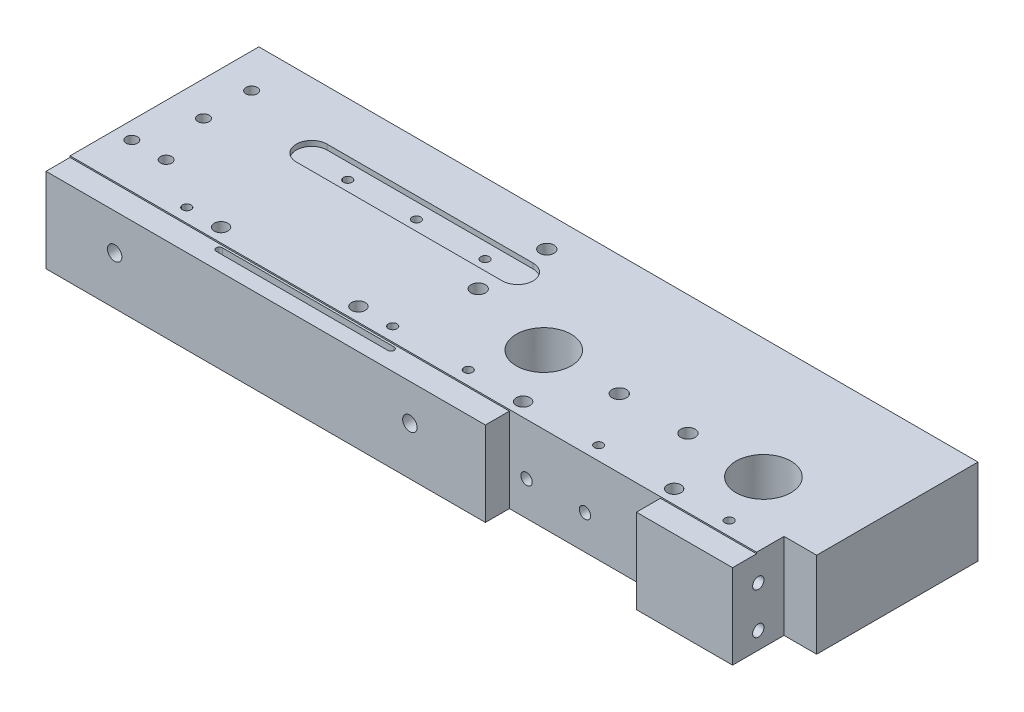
from build123d import *

# Parameters (mm, degrees)
SKETCH_1_W           = 209.5
SKETCH_1_H           = 25
EXTRUDE_1_DEPTH      = 62
SKETCH_2_OUTSIDE_W   = 255.482
SKETCH_2_OUTSIDE_H   = 107.982
SKETCH_2_OUTSIDE_R   = 8
CUT_EXTRUDE_1_DEPTH  = 62
CUT_EXTRUDE_2_DEPTH  = 62
CUT_EXTRUDE_3_DEPTH  = 1.5
SKETCH_5_W           = 128
SKETCH_5_H           = 7
SKETCH_5_W_2         = 28
CUT_EXTRUDE_4_DEPTH  = 0.4
SKETCH_6_R           = 2
SKETCH_6_R_2         = 1.25
SKETCH_6_R_3         = 2.1
SKETCH_6_R_4         = 1.65
CUT_EXTRUDE_5_DEPTH  = 15
SKETCH_7_R           = 1.25
CUT_EXTRUDE_6_DEPTH  = 15
SKETCH_9_R           = 12.5
CUT_EXTRUDE_7_DEPTH  = 13
SKETCH_10_R          = 1.65
CUT_EXTRUDE_8_DEPTH  = 13
SKETCH_11_R          = 2.1
CUT_EXTRUDE_9_DEPTH  = 13
SKETCH_13_R          = 3.375
SKETCH_13_R_2        = 3.5
CUT_EXTRUDE_10_DEPTH = 13
SKETCH_14_R          = 1.65
CUT_EXTRUDE_11_DEPTH = 10


with BuildPart() as part:
    # Sketch 1 → Extrude 1 (new body)
    with BuildSketch(Plane.XY):
        with Locations((104.75, 12.5)):
            Rectangle(SKETCH_1_W, SKETCH_1_H)
    extrude(amount=EXTRUDE_1_DEPTH)

    # Sketch 2 outside → Cut-Extrude 1 (cut)
    # profile 1 of 3: a face of its own
    with BuildSketch(Plane(origin=(0, 25, 0), x_dir=(1, 0, 0), z_dir=(0, 1, 0))):
        with Locations((104.75, -31)):
            Rectangle(SKETCH_2_OUTSIDE_W, SKETCH_2_OUTSIDE_H)
        Polygon((128, -55), (172, -55), (172, -62), (200, -62), (200, -47), (209.5, -47), (209.5, 0), (0, 0), (0, -62), (128, -62), align=None, mode=Mode.SUBTRACT)
    # profile 2 of 3: a face of its own
    with BuildSketch(Plane(origin=(0, 25, 0), x_dir=(1, 0, 0), z_dir=(0, 1, 0))):
        with Locations(Location((118, -35, 0), (0, 0, 270))):
            Circle(SKETCH_2_OUTSIDE_R)
    # profile 3 of 3: a face of its own
    with BuildSketch(Plane(origin=(0, 25, 0), x_dir=(1, 0, 0), z_dir=(0, 1, 0))):
        with Locations(Location((182, -35, 0), (0, 0, 270))):
            Circle(SKETCH_2_OUTSIDE_R)
    extrude(amount=-CUT_EXTRUDE_1_DEPTH, mode=Mode.SUBTRACT)

    # Sketch 3 → Cut-Extrude 2 (cut)
    with BuildSketch(Plane(origin=(0, 25, 0), x_dir=(1, 0, 0), z_dir=(0, 1, 0))):
        with BuildLine():
            Line((45, -55.6), (95, -55.6))
            ThreePointArc((95, -55.6), (95.9, -56.5), (95, -57.4))
            Line((95, -57.4), (45, -57.4))
            ThreePointArc((45, -57.4), (44.1, -56.5), (45, -55.6))
        make_face()
    extrude(amount=-CUT_EXTRUDE_2_DEPTH, mode=Mode.SUBTRACT)

    # Sketch 4 → Cut-Extrude 3 (cut)
    with BuildSketch(Plane(origin=(0, 25, 0), x_dir=(1, 0, 0), z_dir=(0, 1, 0))):
        with BuildLine():
            Line((34.5, -14.6), (94.5, -14.6))
            ThreePointArc((94.5, -14.6), (99, -19.1), (94.5, -23.6))
            Line((94.5, -23.6), (34.5, -23.6))
            ThreePointArc((34.5, -23.6), (30, -19.1), (34.5, -14.6))
        make_face()
    extrude(amount=-CUT_EXTRUDE_3_DEPTH, mode=Mode.SUBTRACT)

    # Sketch 5 → Cut-Extrude 4 (cut)
    with BuildSketch(Plane(origin=(0, 25, 0), x_dir=(1, 0, 0), z_dir=(0, 1, 0))):
        with Locations((64, -58.5)):
            Rectangle(SKETCH_5_W, SKETCH_5_H)
        with Locations((186, -58.5)):
            Rectangle(SKETCH_5_W_2, SKETCH_5_H)
    extrude(amount=-CUT_EXTRUDE_4_DEPTH, mode=Mode.SUBTRACT)

    # Sketch 6 → Cut-Extrude 5 (cut)
    with BuildSketch(Plane(origin=(0, 25, 0), x_dir=(1, 0, 0), z_dir=(0, 1, 0))):
        with Locations(Location((128, -51, 0), (0, 0, 270))):
            Circle(SKETCH_6_R)
        with Locations(Location((172, -51, 0), (0, 0, 270))):
            Circle(SKETCH_6_R)
        with Locations(Location((112, -51, 0), (0, 0, 270))):
            Circle(SKETCH_6_R_2)
        with Locations(Location((150, -51, 0), (0, 0, 270))):
            Circle(SKETCH_6_R_2)
        with Locations(Location((188, -51, 0), (0, 0, 270))):
            Circle(SKETCH_6_R_2)
        with Locations(Location((140, -35, 0), (0, 0, 270))):
            Circle(SKETCH_6_R_3)
        with Locations(Location((160, -35, 0), (0, 0, 270))):
            Circle(SKETCH_6_R_3)
        with Locations(Location((30, -51, 0), (0, 0, 270))):
            Circle(SKETCH_6_R_2)
        with Locations(Location((90, -51, 0), (0, 0, 270))):
            Circle(SKETCH_6_R_2)
        with Locations(Location((40, -51, 0), (0, 0, 270))):
            Circle(SKETCH_6_R)
        with Locations(Location((80, -51, 0), (0, 0, 270))):
            Circle(SKETCH_6_R)
        with Locations(Location((15, -42, 0), (0, 0, 270))):
            Circle(SKETCH_6_R_4)
        with Locations(Location((5, -42, 0), (0, 0, 270))):
            Circle(SKETCH_6_R_4)
        with Locations(Location((10, -12.1, 0), (0, 0, 270))):
            Circle(SKETCH_6_R_4)
        with Locations(Location((10, -26.1, 0), (0, 0, 270))):
            Circle(SKETCH_6_R_4)
        with Locations(Location((93, -9.1, 0), (0, 0, 270))):
            Circle(SKETCH_6_R_3)
        with Locations(Location((93, -29.1, 0), (0, 0, 270))):
            Circle(SKETCH_6_R_3)
    extrude(amount=-CUT_EXTRUDE_5_DEPTH, mode=Mode.SUBTRACT)

    # Sketch 7 → Cut-Extrude 6 (cut)
    with BuildSketch(Plane(origin=(0, 23.5, 0), x_dir=(1, 0, 0), z_dir=(0, 1, 0))):
        with Locations(Location((85, -19.1, 0), (0, 0, 270))):
            Circle(SKETCH_7_R)
        with Locations(Location((65, -19.1, 0), (0, 0, 270))):
            Circle(SKETCH_7_R)
        with Locations(Location((45, -19.1, 0), (0, 0, 270))):
            Circle(SKETCH_7_R)
    extrude(amount=-CUT_EXTRUDE_6_DEPTH, mode=Mode.SUBTRACT)

    # Sketch 9 → Cut-Extrude 7 (cut)
    with BuildSketch(Plane.XZ):
        with Locations(Location((118, 35, 0), (0, 0, 270))):
            Circle(SKETCH_9_R)
        with Locations(Location((182, 35, 0), (0, 0, 270))):
            Circle(SKETCH_9_R)
    extrude(amount=-CUT_EXTRUDE_7_DEPTH, mode=Mode.SUBTRACT)

    # Sketch 10 → Cut-Extrude 8 (cut)
    with BuildSketch(Plane.XY.offset(55)):
        with Locations((133, 10)):
            Circle(SKETCH_10_R)
        with Locations((150, 10)):
            Circle(SKETCH_10_R)
        with Locations((167, 10)):
            Circle(SKETCH_10_R)
    extrude(amount=-CUT_EXTRUDE_8_DEPTH, mode=Mode.SUBTRACT)

    # Sketch 11 → Cut-Extrude 9 (cut)
    with BuildSketch(Plane.XY.offset(62)):
        with Locations((106, 14)):
            Circle(SKETCH_11_R)
        with Locations((20, 14)):
            Circle(SKETCH_11_R)
    extrude(amount=-CUT_EXTRUDE_9_DEPTH, mode=Mode.SUBTRACT)

    # Sketch 13 → Cut-Extrude 10 (cut)
    with BuildSketch(Plane.XZ):
        with Locations(Location((25, 35, 0), (0, 0, 270))):
            Circle(SKETCH_13_R)
        with Locations(Location((25, 10, 0), (0, 0, 270))):
            Circle(SKETCH_13_R_2)
        with Locations(Location((110, 10, 0), (0, 0, 270))):
            Circle(SKETCH_13_R)
        with Locations(Location((190, 10, 0), (0, 0, 270))):
            Circle(SKETCH_13_R)
    extrude(amount=-CUT_EXTRUDE_10_DEPTH, mode=Mode.SUBTRACT)

    # Sketch 14 → Cut-Extrude 11 (cut)
    with BuildSketch(Plane(origin=(200, 0, 0), x_dir=(0, 0, -1), z_dir=(1, 0, 0))):
        with Locations((-54.5, 17)):
            Circle(SKETCH_14_R)
        with Locations((-54.5, 5)):
            Circle(SKETCH_14_R)
    extrude(amount=-CUT_EXTRUDE_11_DEPTH, mode=Mode.SUBTRACT)


solid = part.part
